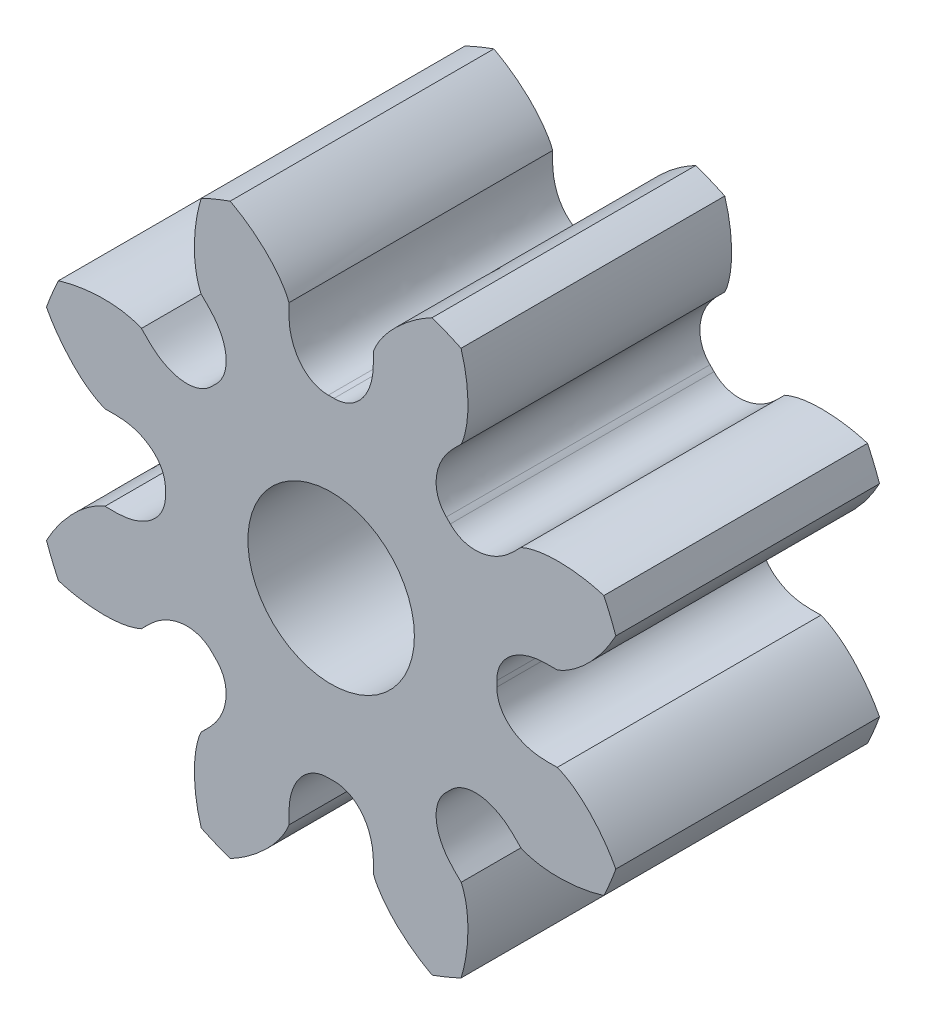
from build123d import *

# Parameters (mm, degrees)
SKETCH3_R         = 4.535714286
GEARBODY_DEPTH    = 3.960000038
TOOTHCUT_DEPTH    = 8.538369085
CIRPATTERN1_COUNT = 8
BOREDIA_R         = 1.25
BORE_DEPTH        = 12700


with BuildPart() as part:
    # Sketch3 → gearBody (new body)
    with BuildSketch(Plane.XY):
        Circle(SKETCH3_R)
    extrude(amount=GEARBODY_DEPTH)

    # Sketch2 → toothCut (cut, through all)
    with BuildSketch(Plane.XY):
        with BuildLine():
            ThreePointArc((2.488837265, -0.042493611), (2.4892, 0), (2.488837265, 0.042493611))
            add(Edge.make_bspline(
                [(2.488837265, 0.042493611), (2.488826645, 0.050675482), (2.488778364, 0.087872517), (2.500147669, 0.177271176), (2.55906549, 0.329741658), (2.737188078, 0.520440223), (3.043641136, 0.640042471), (3.280865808, 0.635437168), (3.395556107, 0.633210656)],
                knots=[0, 0, 0, 0, 0.020194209, 0.091808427, 0.221187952, 0.41692042, 0.718100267, 1, 1, 1, 1], degree=3))
            add(Edge.make_bspline(
                [(3.395556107, 0.633210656), (3.413992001, 0.640455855), (3.451174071, 0.65506819), (3.505063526, 0.682493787), (3.66740431, 0.775790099), (3.919150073, 0.993864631), (4.218779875, 1.3800772), (4.362995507, 1.687735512), (4.438327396, 1.848442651)],
                knots=[0, 0, 0, 0, 0.036273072, 0.073156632, 0.11064777, 0.379214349, 0.675728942, 1, 1, 1, 1], degree=3))
            ThreePointArc((4.438327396, 1.848442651), (4.807857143, 0), (4.438327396, -1.848442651))
            add(Edge.make_bspline(
                [(3.395556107, -0.633210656), (3.413992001, -0.640455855), (3.451174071, -0.65506819), (3.505063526, -0.682493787), (3.66740431, -0.775790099), (3.919150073, -0.993864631), (4.218779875, -1.3800772), (4.362995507, -1.687735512), (4.438327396, -1.848442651)],
                knots=[0, 0, 0, 0, 0.036273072, 0.073156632, 0.11064777, 0.379214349, 0.675728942, 1, 1, 1, 1], degree=3))
            add(Edge.make_bspline(
                [(2.488837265, -0.042493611), (2.488826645, -0.050675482), (2.488778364, -0.087872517), (2.500147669, -0.177271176), (2.55906549, -0.329741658), (2.737188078, -0.520440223), (3.043641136, -0.640042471), (3.280865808, -0.635437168), (3.395556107, -0.633210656)],
                knots=[0, 0, 0, 0, 0.020194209, 0.091808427, 0.221187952, 0.41692042, 0.718100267, 1, 1, 1, 1], degree=3))
        make_face()
    toothcut = extrude(amount=TOOTHCUT_DEPTH, mode=Mode.SUBTRACT)

    # CirPattern1: toothCut ×8 about axis
    cirpattern1_axis = Axis((0, 0, 3.960000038), (0, 0, -1))
    for i in range(1, CIRPATTERN1_COUNT):
        add(toothcut.rotate(cirpattern1_axis, i * 360 / CIRPATTERN1_COUNT), mode=Mode.SUBTRACT)

    # boreDia → bore (cut, symmetric)
    with BuildSketch(Plane.XY):
        Circle(BOREDIA_R)
    extrude(amount=BORE_DEPTH, both=True, mode=Mode.SUBTRACT)


solid = part.part
